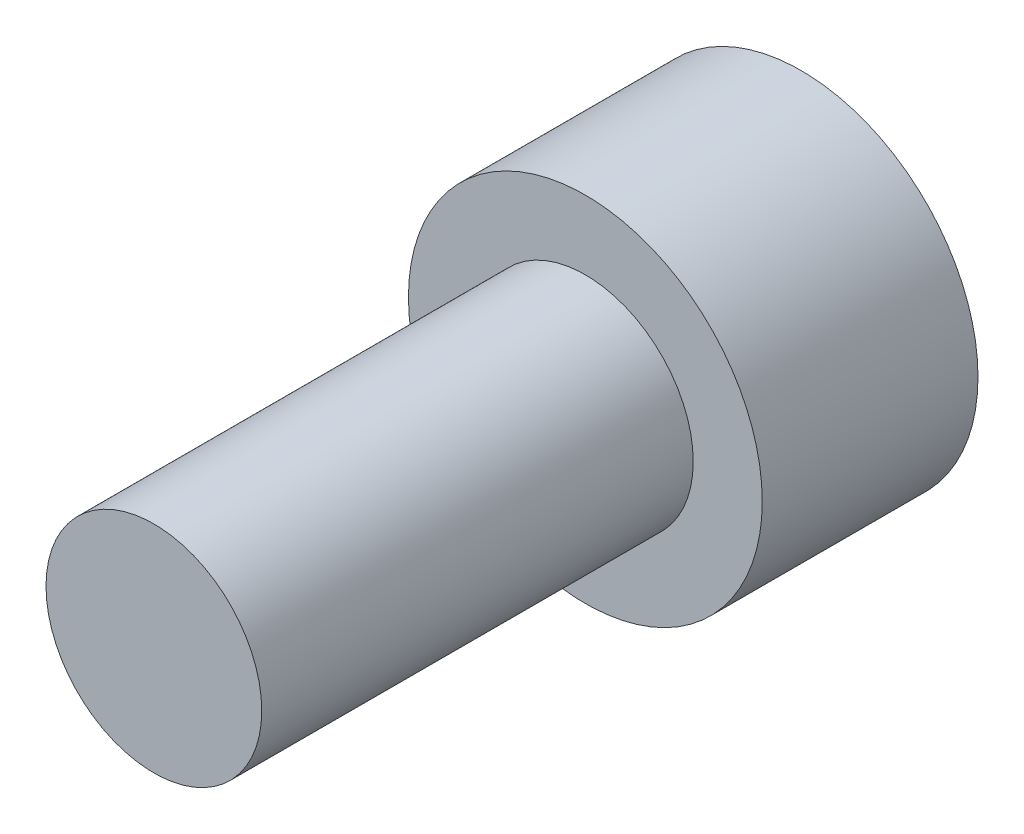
ISO-10303-21;
HEADER;
FILE_DESCRIPTION(('STEP AP214'),'2;1');
FILE_NAME('part.step','',(''),(''),'','','');
FILE_SCHEMA(('AUTOMOTIVE_DESIGN { 1 0 10303 214 1 1 1 1 }'));
ENDSEC;
DATA;
#1=APPLICATION_CONTEXT('core data for automotive mechanical design processes');
#2=APPLICATION_PROTOCOL_DEFINITION('international standard','automotive_design',2000,#1);
#3=PRODUCT_CONTEXT('',#1,'mechanical');
#4=PRODUCT('Part','Part','',(#3));
#5=PRODUCT_RELATED_PRODUCT_CATEGORY('part','',(#4));
#6=PRODUCT_DEFINITION_FORMATION('','',#4);
#7=PRODUCT_DEFINITION_CONTEXT('part definition',#1,'design');
#8=PRODUCT_DEFINITION('design','',#6,#7);
#9=PRODUCT_DEFINITION_SHAPE('','',#8);
#10=(LENGTH_UNIT() NAMED_UNIT(*) SI_UNIT(.MILLI.,.METRE.));
#11=(NAMED_UNIT(*) PLANE_ANGLE_UNIT() SI_UNIT($,.RADIAN.));
#12=(NAMED_UNIT(*) SI_UNIT($,.STERADIAN.) SOLID_ANGLE_UNIT());
#13=UNCERTAINTY_MEASURE_WITH_UNIT(LENGTH_MEASURE(1.E-05),#10,'distance_accuracy_value','');
#14=(GEOMETRIC_REPRESENTATION_CONTEXT(3) GLOBAL_UNCERTAINTY_ASSIGNED_CONTEXT((#13)) GLOBAL_UNIT_ASSIGNED_CONTEXT((#10,
#11,#12)) REPRESENTATION_CONTEXT('',''));
#15=CARTESIAN_POINT('',(0.,0.,0.));
#16=DIRECTION('',(0.,0.,1.));
#17=DIRECTION('',(1.,0.,0.));
#18=AXIS2_PLACEMENT_3D('',#15,#16,#17);
#19=CARTESIAN_POINT('',(0.,0.,6.35));
#20=DIRECTION('',(0.,0.,1.));
#21=DIRECTION('',(1.,0.,0.));
#22=AXIS2_PLACEMENT_3D('',#19,#20,#21);
#23=PLANE('',#22);
#24=CARTESIAN_POINT('',(0.,0.,6.35));
#25=DIRECTION('',(0.,0.,1.));
#26=DIRECTION('',(1.,0.,0.));
#27=AXIS2_PLACEMENT_3D('',#24,#25,#26);
#28=CIRCLE('',#27,1.5875);
#29=CARTESIAN_POINT('',(1.5875,0.,6.35));
#30=VERTEX_POINT('',#29);
#31=EDGE_CURVE('E11',#30,#30,#28,.T.);
#32=ORIENTED_EDGE('',*,*,#31,.T.);
#33=EDGE_LOOP('',(#32));
#34=FACE_BOUND('',#33,.T.);
#35=ADVANCED_FACE('F37',(#34),#23,.T.);
#36=CARTESIAN_POINT('',(0.,0.,6.35));
#37=DIRECTION('',(0.,0.,1.));
#38=DIRECTION('',(1.,0.,0.));
#39=AXIS2_PLACEMENT_3D('',#36,#37,#38);
#40=CYLINDRICAL_SURFACE('',#39,1.5875);
#41=CARTESIAN_POINT('',(0.,0.,0.));
#42=DIRECTION('',(0.,0.,1.));
#43=DIRECTION('',(1.,0.,0.));
#44=AXIS2_PLACEMENT_3D('',#41,#42,#43);
#45=CIRCLE('',#44,1.5875);
#46=CARTESIAN_POINT('',(1.5875,0.,0.));
#47=VERTEX_POINT('',#46);
#48=EDGE_CURVE('E44',#47,#47,#45,.T.);
#49=ORIENTED_EDGE('',*,*,#48,.T.);
#50=EDGE_LOOP('',(#49));
#51=FACE_BOUND('',#50,.T.);
#52=ORIENTED_EDGE('',*,*,#31,.F.);
#53=EDGE_LOOP('',(#52));
#54=FACE_BOUND('',#53,.T.);
#55=ADVANCED_FACE('F151',(#51,#54),#40,.T.);
#56=CARTESIAN_POINT('',(0.,-1.5875,0.));
#57=DIRECTION('',(0.,0.,1.));
#58=DIRECTION('',(1.,0.,0.));
#59=AXIS2_PLACEMENT_3D('',#56,#57,#58);
#60=PLANE('',#59);
#61=CARTESIAN_POINT('',(0.,0.,0.));
#62=DIRECTION('',(0.,0.,1.));
#63=DIRECTION('',(1.,0.,0.));
#64=AXIS2_PLACEMENT_3D('',#61,#62,#63);
#65=CIRCLE('',#64,2.6035);
#66=CARTESIAN_POINT('',(2.6035,0.,0.));
#67=VERTEX_POINT('',#66);
#68=EDGE_CURVE('E146',#67,#67,#65,.T.);
#69=ORIENTED_EDGE('',*,*,#68,.T.);
#70=EDGE_LOOP('',(#69));
#71=FACE_BOUND('',#70,.T.);
#72=ORIENTED_EDGE('',*,*,#48,.F.);
#73=EDGE_LOOP('',(#72));
#74=FACE_BOUND('',#73,.T.);
#75=ADVANCED_FACE('F154',(#71,#74),#60,.T.);
#76=CARTESIAN_POINT('',(0.,0.,6.35));
#77=DIRECTION('',(0.,0.,1.));
#78=DIRECTION('',(1.,0.,0.));
#79=AXIS2_PLACEMENT_3D('',#76,#77,#78);
#80=CYLINDRICAL_SURFACE('',#79,2.6035);
#81=CARTESIAN_POINT('',(0.,0.,-3.175));
#82=DIRECTION('',(0.,0.,1.));
#83=DIRECTION('',(1.,0.,0.));
#84=AXIS2_PLACEMENT_3D('',#81,#82,#83);
#85=CIRCLE('',#84,2.6035);
#86=CARTESIAN_POINT('',(2.6035,0.,-3.175));
#87=VERTEX_POINT('',#86);
#88=EDGE_CURVE('E138',#87,#87,#85,.T.);
#89=ORIENTED_EDGE('',*,*,#88,.T.);
#90=EDGE_LOOP('',(#89));
#91=FACE_BOUND('',#90,.T.);
#92=ORIENTED_EDGE('',*,*,#68,.F.);
#93=EDGE_LOOP('',(#92));
#94=FACE_BOUND('',#93,.T.);
#95=ADVANCED_FACE('F156',(#91,#94),#80,.T.);
#96=CARTESIAN_POINT('',(0.,-2.6035,-3.175));
#97=DIRECTION('',(0.,0.,-1.));
#98=DIRECTION('',(-1.,0.,0.));
#99=AXIS2_PLACEMENT_3D('',#96,#97,#98);
#100=PLANE('',#99);
#101=DIRECTION('',(0.866025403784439,-0.5,0.));
#102=VECTOR('',#101,1.);
#103=CARTESIAN_POINT('',(0.,1.36381680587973,-3.175));
#104=LINE('',#103,#102);
#105=CARTESIAN_POINT('',(0.,1.36381680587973,-3.175));
#106=VERTEX_POINT('',#105);
#107=CARTESIAN_POINT('',(1.1811,0.681908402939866,-3.175));
#108=VERTEX_POINT('',#107);
#109=EDGE_CURVE('E51',#106,#108,#104,.T.);
#110=ORIENTED_EDGE('',*,*,#109,.F.);
#111=DIRECTION('',(0.866025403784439,0.5,0.));
#112=VECTOR('',#111,1.);
#113=CARTESIAN_POINT('',(-1.1811,0.681908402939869,-3.175));
#114=LINE('',#113,#112);
#115=CARTESIAN_POINT('',(-1.1811,0.681908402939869,-3.175));
#116=VERTEX_POINT('',#115);
#117=EDGE_CURVE('E134',#116,#106,#114,.T.);
#118=ORIENTED_EDGE('',*,*,#117,.F.);
#119=DIRECTION('',(0.,1.,0.));
#120=VECTOR('',#119,1.);
#121=CARTESIAN_POINT('',(-1.1811,-0.681908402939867,-3.175));
#122=LINE('',#121,#120);
#123=CARTESIAN_POINT('',(-1.1811,-0.681908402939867,-3.175));
#124=VERTEX_POINT('',#123);
#125=EDGE_CURVE('E132',#124,#116,#122,.T.);
#126=ORIENTED_EDGE('',*,*,#125,.F.);
#127=DIRECTION('',(-0.866025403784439,0.5,0.));
#128=VECTOR('',#127,1.);
#129=CARTESIAN_POINT('',(0.,-1.36381680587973,-3.175));
#130=LINE('',#129,#128);
#131=CARTESIAN_POINT('',(0.,-1.36381680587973,-3.175));
#132=VERTEX_POINT('',#131);
#133=EDGE_CURVE('E99',#132,#124,#130,.T.);
#134=ORIENTED_EDGE('',*,*,#133,.F.);
#135=DIRECTION('',(-0.866025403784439,-0.5,0.));
#136=VECTOR('',#135,1.);
#137=CARTESIAN_POINT('',(1.1811,-0.681908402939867,-3.175));
#138=LINE('',#137,#136);
#139=CARTESIAN_POINT('',(1.1811,-0.681908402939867,-3.175));
#140=VERTEX_POINT('',#139);
#141=EDGE_CURVE('E128',#140,#132,#138,.T.);
#142=ORIENTED_EDGE('',*,*,#141,.F.);
#143=DIRECTION('',(0.,-1.,0.));
#144=VECTOR('',#143,1.);
#145=CARTESIAN_POINT('',(1.1811,0.681908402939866,-3.175));
#146=LINE('',#145,#144);
#147=EDGE_CURVE('E125',#108,#140,#146,.T.);
#148=ORIENTED_EDGE('',*,*,#147,.F.);
#149=EDGE_LOOP('',(#110,#118,#126,#134,#142,#148));
#150=FACE_BOUND('',#149,.T.);
#151=ORIENTED_EDGE('',*,*,#88,.F.);
#152=EDGE_LOOP('',(#151));
#153=FACE_BOUND('',#152,.T.);
#154=ADVANCED_FACE('F163',(#150,#153),#100,.T.);
#155=CARTESIAN_POINT('',(0.,1.36381680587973,-1.397));
#156=DIRECTION('',(0.5,0.866025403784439,0.));
#157=DIRECTION('',(-0.866025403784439,0.5,0.));
#158=AXIS2_PLACEMENT_3D('',#155,#156,#157);
#159=PLANE('',#158);
#160=ORIENTED_EDGE('',*,*,#109,.T.);
#161=DIRECTION('',(0.,0.,-1.));
#162=VECTOR('',#161,1.);
#163=CARTESIAN_POINT('',(1.1811,0.681908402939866,-1.397));
#164=LINE('',#163,#162);
#165=CARTESIAN_POINT('',(1.1811,0.681908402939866,-1.397));
#166=VERTEX_POINT('',#165);
#167=EDGE_CURVE('E81',#166,#108,#164,.T.);
#168=ORIENTED_EDGE('',*,*,#167,.F.);
#169=DIRECTION('',(0.866025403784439,-0.5,0.));
#170=VECTOR('',#169,1.);
#171=CARTESIAN_POINT('',(0.,1.36381680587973,-1.397));
#172=LINE('',#171,#170);
#173=CARTESIAN_POINT('',(0.,1.36381680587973,-1.397));
#174=VERTEX_POINT('',#173);
#175=EDGE_CURVE('E136',#174,#166,#172,.T.);
#176=ORIENTED_EDGE('',*,*,#175,.F.);
#177=DIRECTION('',(0.,0.,-1.));
#178=VECTOR('',#177,1.);
#179=CARTESIAN_POINT('',(0.,1.36381680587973,-1.397));
#180=LINE('',#179,#178);
#181=EDGE_CURVE('E59',#174,#106,#180,.T.);
#182=ORIENTED_EDGE('',*,*,#181,.T.);
#183=EDGE_LOOP('',(#160,#168,#176,#182));
#184=FACE_BOUND('',#183,.T.);
#185=ADVANCED_FACE('F197',(#184),#159,.F.);
#186=CARTESIAN_POINT('',(-1.1811,0.681908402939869,-1.397));
#187=DIRECTION('',(-0.5,0.866025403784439,0.));
#188=DIRECTION('',(-0.866025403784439,-0.5,0.));
#189=AXIS2_PLACEMENT_3D('',#186,#187,#188);
#190=PLANE('',#189);
#191=ORIENTED_EDGE('',*,*,#117,.T.);
#192=ORIENTED_EDGE('',*,*,#181,.F.);
#193=DIRECTION('',(0.866025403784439,0.5,0.));
#194=VECTOR('',#193,1.);
#195=CARTESIAN_POINT('',(-1.1811,0.681908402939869,-1.397));
#196=LINE('',#195,#194);
#197=CARTESIAN_POINT('',(-1.1811,0.681908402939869,-1.397));
#198=VERTEX_POINT('',#197);
#199=EDGE_CURVE('E111',#198,#174,#196,.T.);
#200=ORIENTED_EDGE('',*,*,#199,.F.);
#201=DIRECTION('',(0.,0.,-1.));
#202=VECTOR('',#201,1.);
#203=CARTESIAN_POINT('',(-1.1811,0.681908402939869,-1.397));
#204=LINE('',#203,#202);
#205=EDGE_CURVE('E103',#198,#116,#204,.T.);
#206=ORIENTED_EDGE('',*,*,#205,.T.);
#207=EDGE_LOOP('',(#191,#192,#200,#206));
#208=FACE_BOUND('',#207,.T.);
#209=ADVANCED_FACE('F208',(#208),#190,.F.);
#210=CARTESIAN_POINT('',(-1.1811,-0.681908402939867,-1.397));
#211=DIRECTION('',(-1.,0.,0.));
#212=DIRECTION('',(0.,0.,1.));
#213=AXIS2_PLACEMENT_3D('',#210,#211,#212);
#214=PLANE('',#213);
#215=ORIENTED_EDGE('',*,*,#125,.T.);
#216=ORIENTED_EDGE('',*,*,#205,.F.);
#217=DIRECTION('',(0.,1.,0.));
#218=VECTOR('',#217,1.);
#219=CARTESIAN_POINT('',(-1.1811,-0.681908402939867,-1.397));
#220=LINE('',#219,#218);
#221=CARTESIAN_POINT('',(-1.1811,-0.681908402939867,-1.397));
#222=VERTEX_POINT('',#221);
#223=EDGE_CURVE('E107',#222,#198,#220,.T.);
#224=ORIENTED_EDGE('',*,*,#223,.F.);
#225=DIRECTION('',(0.,0.,-1.));
#226=VECTOR('',#225,1.);
#227=CARTESIAN_POINT('',(-1.1811,-0.681908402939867,-1.397));
#228=LINE('',#227,#226);
#229=EDGE_CURVE('E92',#222,#124,#228,.T.);
#230=ORIENTED_EDGE('',*,*,#229,.T.);
#231=EDGE_LOOP('',(#215,#216,#224,#230));
#232=FACE_BOUND('',#231,.T.);
#233=ADVANCED_FACE('F108',(#232),#214,.F.);
#234=CARTESIAN_POINT('',(0.,-1.36381680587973,-1.397));
#235=DIRECTION('',(-0.5,-0.866025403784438,0.));
#236=DIRECTION('',(0.866025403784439,-0.5,0.));
#237=AXIS2_PLACEMENT_3D('',#234,#235,#236);
#238=PLANE('',#237);
#239=ORIENTED_EDGE('',*,*,#133,.T.);
#240=ORIENTED_EDGE('',*,*,#229,.F.);
#241=DIRECTION('',(-0.866025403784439,0.5,0.));
#242=VECTOR('',#241,1.);
#243=CARTESIAN_POINT('',(0.,-1.36381680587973,-1.397));
#244=LINE('',#243,#242);
#245=CARTESIAN_POINT('',(0.,-1.36381680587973,-1.397));
#246=VERTEX_POINT('',#245);
#247=EDGE_CURVE('E96',#246,#222,#244,.T.);
#248=ORIENTED_EDGE('',*,*,#247,.F.);
#249=DIRECTION('',(0.,0.,-1.));
#250=VECTOR('',#249,1.);
#251=CARTESIAN_POINT('',(0.,-1.36381680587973,-1.397));
#252=LINE('',#251,#250);
#253=EDGE_CURVE('E104',#246,#132,#252,.T.);
#254=ORIENTED_EDGE('',*,*,#253,.T.);
#255=EDGE_LOOP('',(#239,#240,#248,#254));
#256=FACE_BOUND('',#255,.T.);
#257=ADVANCED_FACE('F94',(#256),#238,.F.);
#258=CARTESIAN_POINT('',(1.1811,-0.681908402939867,-1.397));
#259=DIRECTION('',(0.5,-0.866025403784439,0.));
#260=DIRECTION('',(0.866025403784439,0.5,0.));
#261=AXIS2_PLACEMENT_3D('',#258,#259,#260);
#262=PLANE('',#261);
#263=ORIENTED_EDGE('',*,*,#141,.T.);
#264=ORIENTED_EDGE('',*,*,#253,.F.);
#265=DIRECTION('',(-0.866025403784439,-0.5,0.));
#266=VECTOR('',#265,1.);
#267=CARTESIAN_POINT('',(1.1811,-0.681908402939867,-1.397));
#268=LINE('',#267,#266);
#269=CARTESIAN_POINT('',(1.1811,-0.681908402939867,-1.397));
#270=VERTEX_POINT('',#269);
#271=EDGE_CURVE('E117',#270,#246,#268,.T.);
#272=ORIENTED_EDGE('',*,*,#271,.F.);
#273=DIRECTION('',(0.,0.,-1.));
#274=VECTOR('',#273,1.);
#275=CARTESIAN_POINT('',(1.1811,-0.681908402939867,-1.397));
#276=LINE('',#275,#274);
#277=EDGE_CURVE('E141',#270,#140,#276,.T.);
#278=ORIENTED_EDGE('',*,*,#277,.T.);
#279=EDGE_LOOP('',(#263,#264,#272,#278));
#280=FACE_BOUND('',#279,.T.);
#281=ADVANCED_FACE('F236',(#280),#262,.F.);
#282=CARTESIAN_POINT('',(1.1811,0.681908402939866,-1.397));
#283=DIRECTION('',(1.,0.,0.));
#284=DIRECTION('',(0.,1.,0.));
#285=AXIS2_PLACEMENT_3D('',#282,#283,#284);
#286=PLANE('',#285);
#287=ORIENTED_EDGE('',*,*,#147,.T.);
#288=ORIENTED_EDGE('',*,*,#277,.F.);
#289=DIRECTION('',(0.,-1.,0.));
#290=VECTOR('',#289,1.);
#291=CARTESIAN_POINT('',(1.1811,0.681908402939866,-1.397));
#292=LINE('',#291,#290);
#293=EDGE_CURVE('E119',#166,#270,#292,.T.);
#294=ORIENTED_EDGE('',*,*,#293,.F.);
#295=ORIENTED_EDGE('',*,*,#167,.T.);
#296=EDGE_LOOP('',(#287,#288,#294,#295));
#297=FACE_BOUND('',#296,.T.);
#298=ADVANCED_FACE('F246',(#297),#286,.F.);
#299=CARTESIAN_POINT('',(1.1811,0.681908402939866,-1.397));
#300=DIRECTION('',(0.,0.,-1.));
#301=DIRECTION('',(-1.,0.,0.));
#302=AXIS2_PLACEMENT_3D('',#299,#300,#301);
#303=PLANE('',#302);
#304=ORIENTED_EDGE('',*,*,#175,.T.);
#305=ORIENTED_EDGE('',*,*,#293,.T.);
#306=ORIENTED_EDGE('',*,*,#271,.T.);
#307=ORIENTED_EDGE('',*,*,#247,.T.);
#308=ORIENTED_EDGE('',*,*,#223,.T.);
#309=ORIENTED_EDGE('',*,*,#199,.T.);
#310=EDGE_LOOP('',(#304,#305,#306,#307,#308,#309));
#311=FACE_BOUND('',#310,.T.);
#312=ADVANCED_FACE('F114',(#311),#303,.T.);
#313=CLOSED_SHELL('',(#35,#55,#75,#95,#154,#185,#209,#233,#257,#281,#298,#312));
#314=MANIFOLD_SOLID_BREP('B2',#313);
#315=ADVANCED_BREP_SHAPE_REPRESENTATION('',(#18,#314),#14);
#316=SHAPE_DEFINITION_REPRESENTATION(#9,#315);
ENDSEC;
END-ISO-10303-21;
